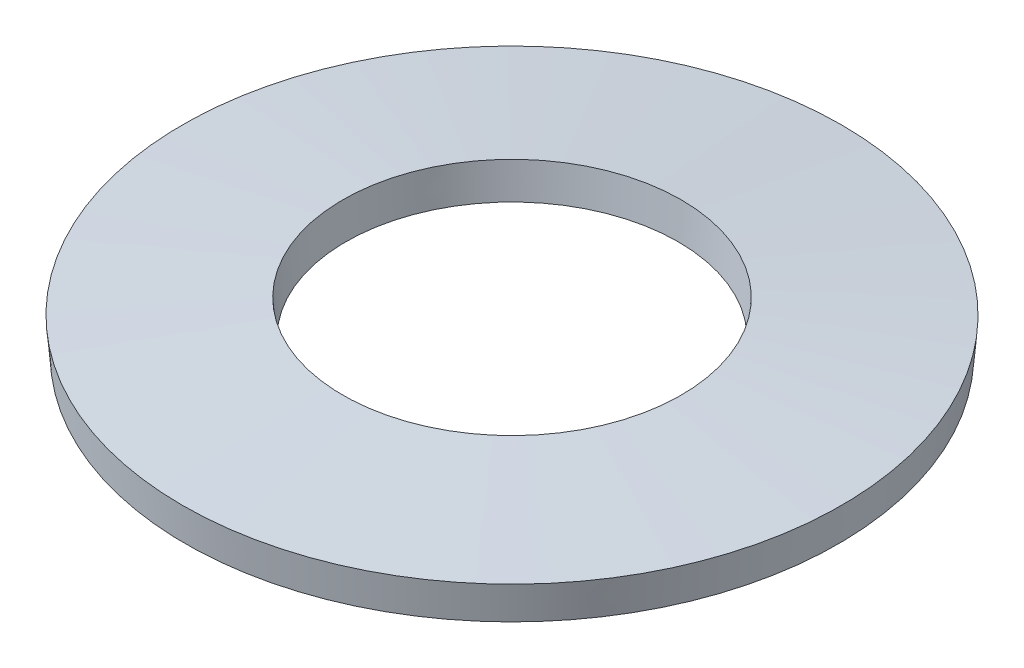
from build123d import *


with BuildPart() as part:
    # Schizzo1 → Rivoluzione1 (revolve)
    with BuildSketch(Plane.XY, mode=Mode.PRIVATE) as rivoluzione1_sk:
        Polygon((14.25, 15.942716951), (14.511467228, 18.931301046), (28.261467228, 17.61988514), (28, 14.631301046), align=None)
    revolve(rivoluzione1_sk.sketch.rotate(Axis((0, 0, 0), (0, 1, 0)), 90), axis=Axis((0, 0, 0), (0, 1, 0)))


solid = part.part
